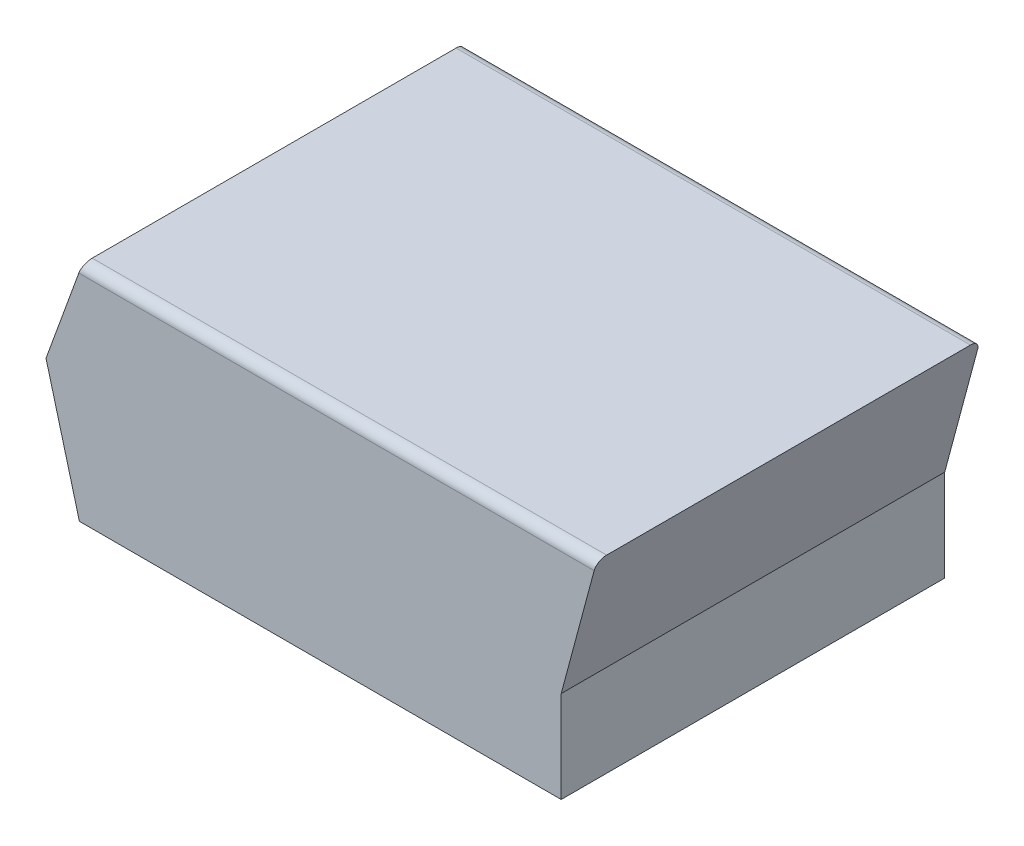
ISO-10303-21;
HEADER;
FILE_DESCRIPTION(('STEP AP214'),'2;1');
FILE_NAME('part.step','',(''),(''),'','','');
FILE_SCHEMA(('AUTOMOTIVE_DESIGN { 1 0 10303 214 1 1 1 1 }'));
ENDSEC;
DATA;
#1=APPLICATION_CONTEXT('core data for automotive mechanical design processes');
#2=APPLICATION_PROTOCOL_DEFINITION('international standard','automotive_design',2000,#1);
#3=PRODUCT_CONTEXT('',#1,'mechanical');
#4=PRODUCT('Part','Part','',(#3));
#5=PRODUCT_RELATED_PRODUCT_CATEGORY('part','',(#4));
#6=PRODUCT_DEFINITION_FORMATION('','',#4);
#7=PRODUCT_DEFINITION_CONTEXT('part definition',#1,'design');
#8=PRODUCT_DEFINITION('design','',#6,#7);
#9=PRODUCT_DEFINITION_SHAPE('','',#8);
#10=(LENGTH_UNIT() NAMED_UNIT(*) SI_UNIT(.MILLI.,.METRE.));
#11=(NAMED_UNIT(*) PLANE_ANGLE_UNIT() SI_UNIT($,.RADIAN.));
#12=(NAMED_UNIT(*) SI_UNIT($,.STERADIAN.) SOLID_ANGLE_UNIT());
#13=UNCERTAINTY_MEASURE_WITH_UNIT(LENGTH_MEASURE(1.E-05),#10,'distance_accuracy_value','');
#14=(GEOMETRIC_REPRESENTATION_CONTEXT(3) GLOBAL_UNCERTAINTY_ASSIGNED_CONTEXT((#13)) GLOBAL_UNIT_ASSIGNED_CONTEXT((#10,
#11,#12)) REPRESENTATION_CONTEXT('',''));
#15=CARTESIAN_POINT('',(0.,0.,0.));
#16=DIRECTION('',(0.,0.,1.));
#17=DIRECTION('',(1.,0.,0.));
#18=AXIS2_PLACEMENT_3D('',#15,#16,#17);
#19=CARTESIAN_POINT('',(-101.820693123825,380.,1170.));
#20=DIRECTION('',(0.965925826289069,0.258819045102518,0.));
#21=DIRECTION('',(-0.258819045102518,0.965925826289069,0.));
#22=AXIS2_PLACEMENT_3D('',#19,#20,#21);
#23=PLANE('',#22);
#24=CARTESIAN_POINT('',(-41.5321248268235,155.,585.));
#25=DIRECTION('',(0.965925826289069,0.258819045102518,0.));
#26=DIRECTION('',(-0.258819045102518,0.965925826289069,0.));
#27=AXIS2_PLACEMENT_3D('',#24,#25,#26);
#28=ELLIPSE('',#27,207.055236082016,200.);
#29=CARTESIAN_POINT('',(-41.5321248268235,155.,385.));
#30=VERTEX_POINT('',#29);
#31=CARTESIAN_POINT('',(-41.5321248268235,155.,785.));
#32=VERTEX_POINT('',#31);
#33=EDGE_CURVE('E11',#30,#32,#28,.T.);
#34=ORIENTED_EDGE('',*,*,#33,.T.);
#35=DIRECTION('',(0.258819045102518,-0.965925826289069,0.));
#36=VECTOR('',#35,1.);
#37=CARTESIAN_POINT('',(-101.820693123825,380.,785.));
#38=LINE('',#37,#36);
#39=CARTESIAN_POINT('',(0.,-1.57607282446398E-13,785.));
#40=VERTEX_POINT('',#39);
#41=EDGE_CURVE('E152',#32,#40,#38,.T.);
#42=ORIENTED_EDGE('',*,*,#41,.T.);
#43=DIRECTION('',(0.,0.,-1.));
#44=VECTOR('',#43,1.);
#45=CARTESIAN_POINT('',(0.,0.,1170.));
#46=LINE('',#45,#44);
#47=CARTESIAN_POINT('',(0.,0.,1170.));
#48=VERTEX_POINT('',#47);
#49=EDGE_CURVE('E194',#48,#40,#46,.T.);
#50=ORIENTED_EDGE('',*,*,#49,.F.);
#51=DIRECTION('',(0.258819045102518,-0.965925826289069,0.));
#52=VECTOR('',#51,1.);
#53=CARTESIAN_POINT('',(-101.820693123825,380.,1170.));
#54=LINE('',#53,#52);
#55=CARTESIAN_POINT('',(-101.820693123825,380.,1170.));
#56=VERTEX_POINT('',#55);
#57=EDGE_CURVE('E156',#56,#48,#54,.T.);
#58=ORIENTED_EDGE('',*,*,#57,.F.);
#59=DIRECTION('',(0.,0.,-1.));
#60=VECTOR('',#59,1.);
#61=CARTESIAN_POINT('',(-101.820693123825,380.,1170.));
#62=LINE('',#61,#60);
#63=CARTESIAN_POINT('',(-101.820693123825,380.,0.));
#64=VERTEX_POINT('',#63);
#65=EDGE_CURVE('E168',#56,#64,#62,.T.);
#66=ORIENTED_EDGE('',*,*,#65,.T.);
#67=DIRECTION('',(0.258819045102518,-0.965925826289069,0.));
#68=VECTOR('',#67,1.);
#69=CARTESIAN_POINT('',(-101.820693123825,380.,0.));
#70=LINE('',#69,#68);
#71=CARTESIAN_POINT('',(0.,0.,0.));
#72=VERTEX_POINT('',#71);
#73=EDGE_CURVE('E155',#64,#72,#70,.T.);
#74=ORIENTED_EDGE('',*,*,#73,.T.);
#75=CARTESIAN_POINT('',(0.,-1.57607282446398E-13,385.));
#76=VERTEX_POINT('',#75);
#77=EDGE_CURVE('E193',#76,#72,#46,.T.);
#78=ORIENTED_EDGE('',*,*,#77,.F.);
#79=DIRECTION('',(-0.258819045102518,0.965925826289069,0.));
#80=VECTOR('',#79,1.);
#81=CARTESIAN_POINT('',(-101.820693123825,380.,385.));
#82=LINE('',#81,#80);
#83=EDGE_CURVE('E147',#76,#30,#82,.T.);
#84=ORIENTED_EDGE('',*,*,#83,.T.);
#85=EDGE_LOOP('',(#34,#42,#50,#58,#66,#74,#78,#84));
#86=FACE_BOUND('',#85,.T.);
#87=ADVANCED_FACE('F32',(#86),#23,.F.);
#88=CARTESIAN_POINT('',(0.,0.,1170.));
#89=DIRECTION('',(0.,1.,0.));
#90=DIRECTION('',(0.,0.,1.));
#91=AXIS2_PLACEMENT_3D('',#88,#89,#90);
#92=PLANE('',#91);
#93=ORIENTED_EDGE('',*,*,#49,.T.);
#94=DIRECTION('',(-1.,0.,0.));
#95=VECTOR('',#94,1.);
#96=CARTESIAN_POINT('',(50.,-1.57607282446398E-13,785.));
#97=LINE('',#96,#95);
#98=CARTESIAN_POINT('',(50.,-1.57607282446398E-13,785.));
#99=VERTEX_POINT('',#98);
#100=EDGE_CURVE('E148',#99,#40,#97,.T.);
#101=ORIENTED_EDGE('',*,*,#100,.F.);
#102=DIRECTION('',(0.,0.,1.));
#103=VECTOR('',#102,1.);
#104=CARTESIAN_POINT('',(50.,-1.57607282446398E-13,385.));
#105=LINE('',#104,#103);
#106=CARTESIAN_POINT('',(50.,0.,385.));
#107=VERTEX_POINT('',#106);
#108=EDGE_CURVE('E137',#107,#99,#105,.T.);
#109=ORIENTED_EDGE('',*,*,#108,.F.);
#110=DIRECTION('',(-1.,0.,0.));
#111=VECTOR('',#110,1.);
#112=CARTESIAN_POINT('',(50.,-1.57607282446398E-13,385.));
#113=LINE('',#112,#111);
#114=EDGE_CURVE('E131',#107,#76,#113,.T.);
#115=ORIENTED_EDGE('',*,*,#114,.T.);
#116=ORIENTED_EDGE('',*,*,#77,.T.);
#117=DIRECTION('',(1.,0.,0.));
#118=VECTOR('',#117,1.);
#119=CARTESIAN_POINT('',(0.,0.,0.));
#120=LINE('',#119,#118);
#121=CARTESIAN_POINT('',(1470.,0.,0.));
#122=VERTEX_POINT('',#121);
#123=EDGE_CURVE('E171',#72,#122,#120,.T.);
#124=ORIENTED_EDGE('',*,*,#123,.T.);
#125=DIRECTION('',(0.,0.,-1.));
#126=VECTOR('',#125,1.);
#127=CARTESIAN_POINT('',(1470.,0.,1170.));
#128=LINE('',#127,#126);
#129=CARTESIAN_POINT('',(1470.,0.,1170.));
#130=VERTEX_POINT('',#129);
#131=EDGE_CURVE('E190',#130,#122,#128,.T.);
#132=ORIENTED_EDGE('',*,*,#131,.F.);
#133=DIRECTION('',(1.,0.,0.));
#134=VECTOR('',#133,1.);
#135=CARTESIAN_POINT('',(0.,0.,1170.));
#136=LINE('',#135,#134);
#137=EDGE_CURVE('E159',#48,#130,#136,.T.);
#138=ORIENTED_EDGE('',*,*,#137,.F.);
#139=EDGE_LOOP('',(#93,#101,#109,#115,#116,#124,#132,#138));
#140=FACE_BOUND('',#139,.T.);
#141=ADVANCED_FACE('F229',(#140),#92,.F.);
#142=CARTESIAN_POINT('',(1470.,0.,1170.));
#143=DIRECTION('',(-1.,0.,0.));
#144=DIRECTION('',(0.,0.,1.));
#145=AXIS2_PLACEMENT_3D('',#142,#143,#144);
#146=PLANE('',#145);
#147=DIRECTION('',(0.,1.,0.));
#148=VECTOR('',#147,1.);
#149=CARTESIAN_POINT('',(1470.,0.,0.));
#150=LINE('',#149,#148);
#151=CARTESIAN_POINT('',(1470.,280.,0.));
#152=VERTEX_POINT('',#151);
#153=EDGE_CURVE('E173',#122,#152,#150,.T.);
#154=ORIENTED_EDGE('',*,*,#153,.T.);
#155=DIRECTION('',(0.,0.,-1.));
#156=VECTOR('',#155,1.);
#157=CARTESIAN_POINT('',(1470.,280.,1170.));
#158=LINE('',#157,#156);
#159=CARTESIAN_POINT('',(1470.,280.,1170.));
#160=VERTEX_POINT('',#159);
#161=EDGE_CURVE('E187',#160,#152,#158,.T.);
#162=ORIENTED_EDGE('',*,*,#161,.F.);
#163=DIRECTION('',(0.,1.,0.));
#164=VECTOR('',#163,1.);
#165=CARTESIAN_POINT('',(1470.,0.,1170.));
#166=LINE('',#165,#164);
#167=EDGE_CURVE('E162',#130,#160,#166,.T.);
#168=ORIENTED_EDGE('',*,*,#167,.F.);
#169=ORIENTED_EDGE('',*,*,#131,.T.);
#170=EDGE_LOOP('',(#154,#162,#168,#169));
#171=FACE_BOUND('',#170,.T.);
#172=ADVANCED_FACE('F233',(#171),#146,.F.);
#173=CARTESIAN_POINT('',(1470.,280.,1170.));
#174=DIRECTION('',(-0.965925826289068,0.258819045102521,0.));
#175=DIRECTION('',(-0.258819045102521,-0.965925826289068,0.));
#176=AXIS2_PLACEMENT_3D('',#173,#174,#175);
#177=PLANE('',#176);
#178=DIRECTION('',(0.258819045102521,0.965925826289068,0.));
#179=VECTOR('',#178,1.);
#180=CARTESIAN_POINT('',(1470.,280.,0.));
#181=LINE('',#180,#179);
#182=CARTESIAN_POINT('',(1570.48094716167,655.,0.));
#183=VERTEX_POINT('',#182);
#184=EDGE_CURVE('E175',#152,#183,#181,.T.);
#185=ORIENTED_EDGE('',*,*,#184,.T.);
#186=CARTESIAN_POINT('',(1570.48094716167,655.,30.));
#187=DIRECTION('',(-0.965925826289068,0.258819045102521,0.));
#188=DIRECTION('',(-0.258819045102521,-0.965925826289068,0.));
#189=AXIS2_PLACEMENT_3D('',#186,#187,#188);
#190=ELLIPSE('',#189,31.0582854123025,30.);
#191=CARTESIAN_POINT('',(1578.5194229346,685.,30.));
#192=VERTEX_POINT('',#191);
#193=EDGE_CURVE('E209',#183,#192,#190,.F.);
#194=ORIENTED_EDGE('',*,*,#193,.T.);
#195=DIRECTION('',(0.,0.,-1.));
#196=VECTOR('',#195,1.);
#197=CARTESIAN_POINT('',(1578.5194229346,685.,1170.));
#198=LINE('',#197,#196);
#199=CARTESIAN_POINT('',(1578.5194229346,685.,1140.));
#200=VERTEX_POINT('',#199);
#201=EDGE_CURVE('E184',#200,#192,#198,.T.);
#202=ORIENTED_EDGE('',*,*,#201,.F.);
#203=CARTESIAN_POINT('',(1570.48094716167,655.,1140.));
#204=DIRECTION('',(-0.965925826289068,0.258819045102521,0.));
#205=DIRECTION('',(0.258819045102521,0.965925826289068,0.));
#206=AXIS2_PLACEMENT_3D('',#203,#204,#205);
#207=ELLIPSE('',#206,31.0582854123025,30.);
#208=CARTESIAN_POINT('',(1570.48094716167,655.,1170.));
#209=VERTEX_POINT('',#208);
#210=EDGE_CURVE('E55',#200,#209,#207,.F.);
#211=ORIENTED_EDGE('',*,*,#210,.T.);
#212=DIRECTION('',(0.258819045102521,0.965925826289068,0.));
#213=VECTOR('',#212,1.);
#214=CARTESIAN_POINT('',(1470.,280.,1170.));
#215=LINE('',#214,#213);
#216=EDGE_CURVE('E164',#160,#209,#215,.T.);
#217=ORIENTED_EDGE('',*,*,#216,.F.);
#218=ORIENTED_EDGE('',*,*,#161,.T.);
#219=EDGE_LOOP('',(#185,#194,#202,#211,#217,#218));
#220=FACE_BOUND('',#219,.T.);
#221=ADVANCED_FACE('F235',(#220),#177,.F.);
#222=CARTESIAN_POINT('',(1578.5194229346,685.,1170.));
#223=DIRECTION('',(0.,-1.,0.));
#224=DIRECTION('',(1.,0.,0.));
#225=AXIS2_PLACEMENT_3D('',#222,#223,#224);
#226=PLANE('',#225);
#227=ORIENTED_EDGE('',*,*,#201,.T.);
#228=DIRECTION('',(-1.,0.,0.));
#229=VECTOR('',#228,1.);
#230=CARTESIAN_POINT('',(1578.5194229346,685.,30.));
#231=LINE('',#230,#229);
#232=CARTESIAN_POINT('',(9.19022832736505,685.,30.));
#233=VERTEX_POINT('',#232);
#234=EDGE_CURVE('E199',#192,#233,#231,.T.);
#235=ORIENTED_EDGE('',*,*,#234,.T.);
#236=DIRECTION('',(0.,0.,-1.));
#237=VECTOR('',#236,1.);
#238=CARTESIAN_POINT('',(9.19022832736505,685.,1170.));
#239=LINE('',#238,#237);
#240=CARTESIAN_POINT('',(9.19022832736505,685.,1140.));
#241=VERTEX_POINT('',#240);
#242=EDGE_CURVE('E181',#241,#233,#239,.T.);
#243=ORIENTED_EDGE('',*,*,#242,.F.);
#244=DIRECTION('',(-1.,0.,0.));
#245=VECTOR('',#244,1.);
#246=CARTESIAN_POINT('',(1578.5194229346,685.,1140.));
#247=LINE('',#246,#245);
#248=EDGE_CURVE('E197',#241,#200,#247,.F.);
#249=ORIENTED_EDGE('',*,*,#248,.T.);
#250=EDGE_LOOP('',(#227,#235,#243,#249));
#251=FACE_BOUND('',#250,.T.);
#252=ADVANCED_FACE('F238',(#251),#226,.F.);
#253=CARTESIAN_POINT('',(9.19022832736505,685.,1170.));
#254=DIRECTION('',(0.93969262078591,-0.342020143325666,0.));
#255=DIRECTION('',(0.342020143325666,0.93969262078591,0.));
#256=AXIS2_PLACEMENT_3D('',#253,#254,#255);
#257=PLANE('',#256);
#258=ORIENTED_EDGE('',*,*,#242,.T.);
#259=CARTESIAN_POINT('',(-1.72887870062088,655.,30.));
#260=DIRECTION('',(0.93969262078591,-0.342020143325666,0.));
#261=DIRECTION('',(-0.342020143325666,-0.93969262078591,0.));
#262=AXIS2_PLACEMENT_3D('',#259,#260,#261);
#263=ELLIPSE('',#262,31.9253331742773,30.);
#264=CARTESIAN_POINT('',(-1.72887870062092,655.,0.));
#265=VERTEX_POINT('',#264);
#266=EDGE_CURVE('E204',#233,#265,#263,.F.);
#267=ORIENTED_EDGE('',*,*,#266,.T.);
#268=DIRECTION('',(-0.342020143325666,-0.93969262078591,0.));
#269=VECTOR('',#268,1.);
#270=CARTESIAN_POINT('',(9.19022832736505,685.,0.));
#271=LINE('',#270,#269);
#272=EDGE_CURVE('E160',#265,#64,#271,.T.);
#273=ORIENTED_EDGE('',*,*,#272,.T.);
#274=ORIENTED_EDGE('',*,*,#65,.F.);
#275=DIRECTION('',(-0.342020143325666,-0.93969262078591,0.));
#276=VECTOR('',#275,1.);
#277=CARTESIAN_POINT('',(9.19022832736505,685.,1170.));
#278=LINE('',#277,#276);
#279=CARTESIAN_POINT('',(-1.72887870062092,655.,1170.));
#280=VERTEX_POINT('',#279);
#281=EDGE_CURVE('E166',#280,#56,#278,.T.);
#282=ORIENTED_EDGE('',*,*,#281,.F.);
#283=CARTESIAN_POINT('',(-1.72887870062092,655.,1140.));
#284=DIRECTION('',(0.93969262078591,-0.342020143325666,0.));
#285=DIRECTION('',(0.342020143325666,0.93969262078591,0.));
#286=AXIS2_PLACEMENT_3D('',#283,#284,#285);
#287=ELLIPSE('',#286,31.9253331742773,30.);
#288=EDGE_CURVE('E202',#280,#241,#287,.F.);
#289=ORIENTED_EDGE('',*,*,#288,.T.);
#290=EDGE_LOOP('',(#258,#267,#273,#274,#282,#289));
#291=FACE_BOUND('',#290,.T.);
#292=ADVANCED_FACE('F218',(#291),#257,.F.);
#293=CARTESIAN_POINT('',(0.,0.,1170.));
#294=DIRECTION('',(0.,0.,1.));
#295=DIRECTION('',(1.,0.,0.));
#296=AXIS2_PLACEMENT_3D('',#293,#294,#295);
#297=PLANE('',#296);
#298=ORIENTED_EDGE('',*,*,#216,.T.);
#299=DIRECTION('',(-1.,0.,0.));
#300=VECTOR('',#299,1.);
#301=CARTESIAN_POINT('',(9.19022832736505,655.,1170.));
#302=LINE('',#301,#300);
#303=EDGE_CURVE('E40',#209,#280,#302,.T.);
#304=ORIENTED_EDGE('',*,*,#303,.T.);
#305=ORIENTED_EDGE('',*,*,#281,.T.);
#306=ORIENTED_EDGE('',*,*,#57,.T.);
#307=ORIENTED_EDGE('',*,*,#137,.T.);
#308=ORIENTED_EDGE('',*,*,#167,.T.);
#309=EDGE_LOOP('',(#298,#304,#305,#306,#307,#308));
#310=FACE_BOUND('',#309,.T.);
#311=ADVANCED_FACE('F214',(#310),#297,.T.);
#312=CARTESIAN_POINT('',(0.,0.,0.));
#313=DIRECTION('',(0.,0.,1.));
#314=DIRECTION('',(1.,0.,0.));
#315=AXIS2_PLACEMENT_3D('',#312,#313,#314);
#316=PLANE('',#315);
#317=ORIENTED_EDGE('',*,*,#272,.F.);
#318=DIRECTION('',(-1.,0.,0.));
#319=VECTOR('',#318,1.);
#320=CARTESIAN_POINT('',(0.,655.,0.));
#321=LINE('',#320,#319);
#322=EDGE_CURVE('E206',#265,#183,#321,.F.);
#323=ORIENTED_EDGE('',*,*,#322,.T.);
#324=ORIENTED_EDGE('',*,*,#184,.F.);
#325=ORIENTED_EDGE('',*,*,#153,.F.);
#326=ORIENTED_EDGE('',*,*,#123,.F.);
#327=ORIENTED_EDGE('',*,*,#73,.F.);
#328=EDGE_LOOP('',(#317,#323,#324,#325,#326,#327));
#329=FACE_BOUND('',#328,.T.);
#330=ADVANCED_FACE('F255',(#329),#316,.F.);
#331=CARTESIAN_POINT('',(1578.5194229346,655.,30.));
#332=DIRECTION('',(-1.,0.,0.));
#333=DIRECTION('',(0.,-1.,0.));
#334=AXIS2_PLACEMENT_3D('',#331,#332,#333);
#335=CYLINDRICAL_SURFACE('',#334,30.);
#336=ORIENTED_EDGE('',*,*,#193,.F.);
#337=ORIENTED_EDGE('',*,*,#322,.F.);
#338=ORIENTED_EDGE('',*,*,#266,.F.);
#339=ORIENTED_EDGE('',*,*,#234,.F.);
#340=EDGE_LOOP('',(#336,#337,#338,#339));
#341=FACE_BOUND('',#340,.T.);
#342=ADVANCED_FACE('F253',(#341),#335,.T.);
#343=CARTESIAN_POINT('',(0.,655.,1140.));
#344=DIRECTION('',(1.,0.,0.));
#345=DIRECTION('',(0.,1.,0.));
#346=AXIS2_PLACEMENT_3D('',#343,#344,#345);
#347=CYLINDRICAL_SURFACE('',#346,30.);
#348=ORIENTED_EDGE('',*,*,#210,.F.);
#349=ORIENTED_EDGE('',*,*,#248,.F.);
#350=ORIENTED_EDGE('',*,*,#288,.F.);
#351=ORIENTED_EDGE('',*,*,#303,.F.);
#352=EDGE_LOOP('',(#348,#349,#350,#351));
#353=FACE_BOUND('',#352,.T.);
#354=ADVANCED_FACE('F34',(#353),#347,.T.);
#355=CARTESIAN_POINT('',(50.,155.,585.));
#356=DIRECTION('',(-1.,0.,0.));
#357=DIRECTION('',(0.,0.,1.));
#358=AXIS2_PLACEMENT_3D('',#355,#356,#357);
#359=CYLINDRICAL_SURFACE('',#358,200.);
#360=DIRECTION('',(-1.,0.,0.));
#361=VECTOR('',#360,1.);
#362=CARTESIAN_POINT('',(50.,155.,385.));
#363=LINE('',#362,#361);
#364=CARTESIAN_POINT('',(50.,155.,385.));
#365=VERTEX_POINT('',#364);
#366=EDGE_CURVE('E124',#365,#30,#363,.T.);
#367=ORIENTED_EDGE('',*,*,#366,.F.);
#368=CARTESIAN_POINT('',(50.,155.,585.));
#369=DIRECTION('',(-1.,0.,0.));
#370=DIRECTION('',(0.,0.,1.));
#371=AXIS2_PLACEMENT_3D('',#368,#369,#370);
#372=CIRCLE('',#371,200.);
#373=CARTESIAN_POINT('',(50.,155.,785.));
#374=VERTEX_POINT('',#373);
#375=EDGE_CURVE('E127',#374,#365,#372,.T.);
#376=ORIENTED_EDGE('',*,*,#375,.F.);
#377=DIRECTION('',(-1.,0.,0.));
#378=VECTOR('',#377,1.);
#379=CARTESIAN_POINT('',(50.,155.,785.));
#380=LINE('',#379,#378);
#381=EDGE_CURVE('E145',#374,#32,#380,.T.);
#382=ORIENTED_EDGE('',*,*,#381,.T.);
#383=ORIENTED_EDGE('',*,*,#33,.F.);
#384=EDGE_LOOP('',(#367,#376,#382,#383));
#385=FACE_BOUND('',#384,.T.);
#386=ADVANCED_FACE('F125',(#385),#359,.F.);
#387=CARTESIAN_POINT('',(50.,-1.57607282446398E-13,785.));
#388=DIRECTION('',(0.,0.,1.));
#389=DIRECTION('',(1.,0.,0.));
#390=AXIS2_PLACEMENT_3D('',#387,#388,#389);
#391=PLANE('',#390);
#392=ORIENTED_EDGE('',*,*,#381,.F.);
#393=DIRECTION('',(0.,1.,0.));
#394=VECTOR('',#393,1.);
#395=CARTESIAN_POINT('',(50.,-1.57607282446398E-13,785.));
#396=LINE('',#395,#394);
#397=EDGE_CURVE('E132',#99,#374,#396,.T.);
#398=ORIENTED_EDGE('',*,*,#397,.F.);
#399=ORIENTED_EDGE('',*,*,#100,.T.);
#400=ORIENTED_EDGE('',*,*,#41,.F.);
#401=EDGE_LOOP('',(#392,#398,#399,#400));
#402=FACE_BOUND('',#401,.T.);
#403=ADVANCED_FACE('F269',(#402),#391,.F.);
#404=CARTESIAN_POINT('',(50.,155.,385.));
#405=DIRECTION('',(0.,0.,-1.));
#406=DIRECTION('',(0.,1.,0.));
#407=AXIS2_PLACEMENT_3D('',#404,#405,#406);
#408=PLANE('',#407);
#409=ORIENTED_EDGE('',*,*,#114,.F.);
#410=DIRECTION('',(0.,-1.,0.));
#411=VECTOR('',#410,1.);
#412=CARTESIAN_POINT('',(50.,155.,385.));
#413=LINE('',#412,#411);
#414=EDGE_CURVE('E47',#365,#107,#413,.T.);
#415=ORIENTED_EDGE('',*,*,#414,.F.);
#416=ORIENTED_EDGE('',*,*,#366,.T.);
#417=ORIENTED_EDGE('',*,*,#83,.F.);
#418=EDGE_LOOP('',(#409,#415,#416,#417));
#419=FACE_BOUND('',#418,.T.);
#420=ADVANCED_FACE('F134',(#419),#408,.F.);
#421=CARTESIAN_POINT('',(50.,155.,585.));
#422=DIRECTION('',(-1.,0.,0.));
#423=DIRECTION('',(0.,0.,1.));
#424=AXIS2_PLACEMENT_3D('',#421,#422,#423);
#425=PLANE('',#424);
#426=ORIENTED_EDGE('',*,*,#375,.T.);
#427=ORIENTED_EDGE('',*,*,#414,.T.);
#428=ORIENTED_EDGE('',*,*,#108,.T.);
#429=ORIENTED_EDGE('',*,*,#397,.T.);
#430=EDGE_LOOP('',(#426,#427,#428,#429));
#431=FACE_BOUND('',#430,.T.);
#432=ADVANCED_FACE('F139',(#431),#425,.T.);
#433=CLOSED_SHELL('',(#87,#141,#172,#221,#252,#292,#311,#330,#342,#354,#386,#403,#420,#432));
#434=MANIFOLD_SOLID_BREP('B2',#433);
#435=ADVANCED_BREP_SHAPE_REPRESENTATION('',(#18,#434),#14);
#436=SHAPE_DEFINITION_REPRESENTATION(#9,#435);
ENDSEC;
END-ISO-10303-21;
